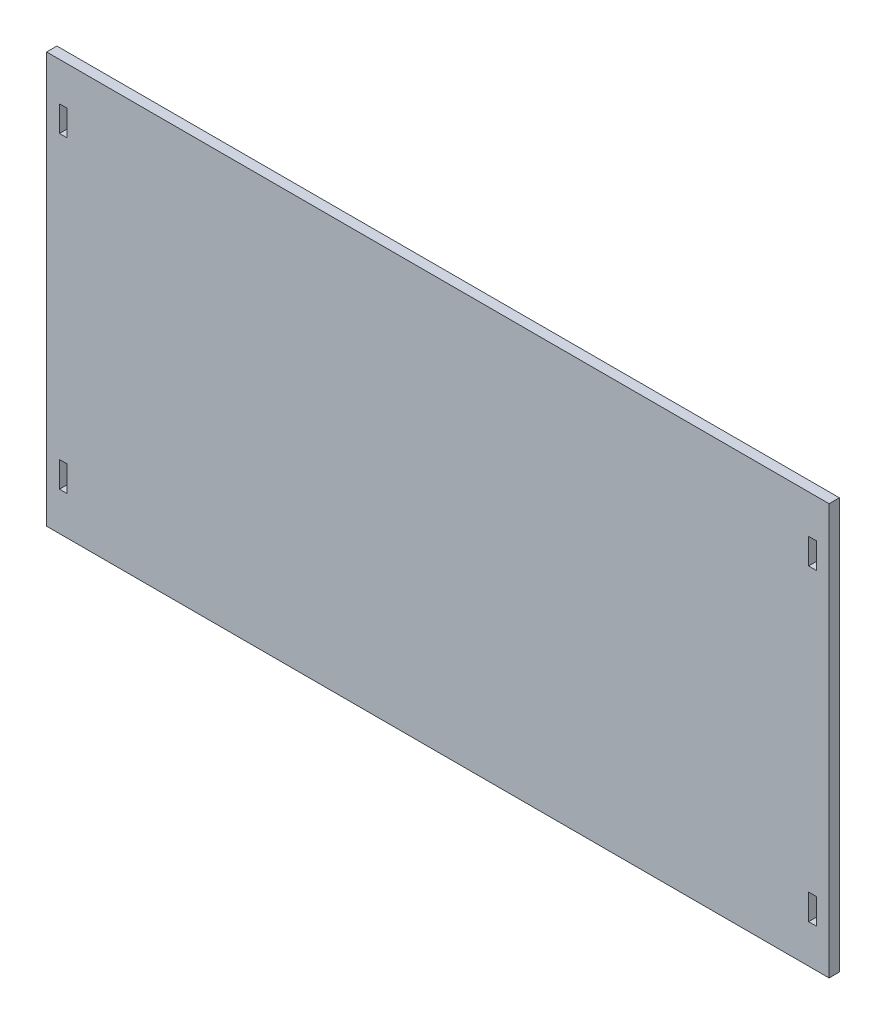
ISO-10303-21;
HEADER;
FILE_DESCRIPTION(('STEP AP214'),'2;1');
FILE_NAME('part.step','',(''),(''),'','','');
FILE_SCHEMA(('AUTOMOTIVE_DESIGN { 1 0 10303 214 1 1 1 1 }'));
ENDSEC;
DATA;
#1=APPLICATION_CONTEXT('core data for automotive mechanical design processes');
#2=APPLICATION_PROTOCOL_DEFINITION('international standard','automotive_design',2000,#1);
#3=PRODUCT_CONTEXT('',#1,'mechanical');
#4=PRODUCT('Part','Part','',(#3));
#5=PRODUCT_RELATED_PRODUCT_CATEGORY('part','',(#4));
#6=PRODUCT_DEFINITION_FORMATION('','',#4);
#7=PRODUCT_DEFINITION_CONTEXT('part definition',#1,'design');
#8=PRODUCT_DEFINITION('design','',#6,#7);
#9=PRODUCT_DEFINITION_SHAPE('','',#8);
#10=(LENGTH_UNIT() NAMED_UNIT(*) SI_UNIT(.MILLI.,.METRE.));
#11=(NAMED_UNIT(*) PLANE_ANGLE_UNIT() SI_UNIT($,.RADIAN.));
#12=(NAMED_UNIT(*) SI_UNIT($,.STERADIAN.) SOLID_ANGLE_UNIT());
#13=UNCERTAINTY_MEASURE_WITH_UNIT(LENGTH_MEASURE(1.E-05),#10,'distance_accuracy_value','');
#14=(GEOMETRIC_REPRESENTATION_CONTEXT(3) GLOBAL_UNCERTAINTY_ASSIGNED_CONTEXT((#13)) GLOBAL_UNIT_ASSIGNED_CONTEXT((#10,
#11,#12)) REPRESENTATION_CONTEXT('',''));
#15=CARTESIAN_POINT('',(0.,0.,0.));
#16=DIRECTION('',(0.,0.,1.));
#17=DIRECTION('',(1.,0.,0.));
#18=AXIS2_PLACEMENT_3D('',#15,#16,#17);
#19=CARTESIAN_POINT('',(0.,0.,4.));
#20=DIRECTION('',(0.,0.,1.));
#21=DIRECTION('',(1.,0.,0.));
#22=AXIS2_PLACEMENT_3D('',#19,#20,#21);
#23=PLANE('',#22);
#24=DIRECTION('',(0.,1.,0.));
#25=VECTOR('',#24,1.);
#26=CARTESIAN_POINT('',(240.959847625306,21.1041826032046,4.));
#27=LINE('',#26,#25);
#28=CARTESIAN_POINT('',(240.959847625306,-128.895817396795,4.));
#29=VERTEX_POINT('',#28);
#30=CARTESIAN_POINT('',(240.959847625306,31.1041826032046,4.));
#31=VERTEX_POINT('',#30);
#32=EDGE_CURVE('E299',#29,#31,#27,.T.);
#33=ORIENTED_EDGE('',*,*,#32,.T.);
#34=DIRECTION('',(-1.,0.,0.));
#35=VECTOR('',#34,1.);
#36=CARTESIAN_POINT('',(-63.8401523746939,31.1041826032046,4.));
#37=LINE('',#36,#35);
#38=CARTESIAN_POINT('',(-63.8401523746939,31.1041826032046,4.));
#39=VERTEX_POINT('',#38);
#40=EDGE_CURVE('E301',#31,#39,#37,.T.);
#41=ORIENTED_EDGE('',*,*,#40,.T.);
#42=DIRECTION('',(0.,-1.,0.));
#43=VECTOR('',#42,1.);
#44=CARTESIAN_POINT('',(-63.8401523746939,21.1041826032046,4.));
#45=LINE('',#44,#43);
#46=CARTESIAN_POINT('',(-63.8401523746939,-128.895817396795,4.));
#47=VERTEX_POINT('',#46);
#48=EDGE_CURVE('E304',#39,#47,#45,.T.);
#49=ORIENTED_EDGE('',*,*,#48,.T.);
#50=DIRECTION('',(1.,0.,0.));
#51=VECTOR('',#50,1.);
#52=CARTESIAN_POINT('',(-63.8401523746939,-128.895817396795,4.));
#53=LINE('',#52,#51);
#54=EDGE_CURVE('E306',#47,#29,#53,.T.);
#55=ORIENTED_EDGE('',*,*,#54,.T.);
#56=EDGE_LOOP('',(#33,#41,#49,#55));
#57=FACE_BOUND('',#56,.T.);
#58=DIRECTION('',(-1.,0.,0.));
#59=VECTOR('',#58,1.);
#60=CARTESIAN_POINT('',(-58.8401523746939,16.1041826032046,4.));
#61=LINE('',#60,#59);
#62=CARTESIAN_POINT('',(-55.8401523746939,16.1041826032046,4.));
#63=VERTEX_POINT('',#62);
#64=CARTESIAN_POINT('',(-58.8401523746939,16.1041826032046,4.));
#65=VERTEX_POINT('',#64);
#66=EDGE_CURVE('E286',#63,#65,#61,.T.);
#67=ORIENTED_EDGE('',*,*,#66,.F.);
#68=DIRECTION('',(0.,1.,0.));
#69=VECTOR('',#68,1.);
#70=CARTESIAN_POINT('',(-55.8401523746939,16.1041826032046,4.));
#71=LINE('',#70,#69);
#72=CARTESIAN_POINT('',(-55.8401523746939,6.10418260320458,4.));
#73=VERTEX_POINT('',#72);
#74=EDGE_CURVE('E289',#73,#63,#71,.T.);
#75=ORIENTED_EDGE('',*,*,#74,.F.);
#76=DIRECTION('',(1.,0.,0.));
#77=VECTOR('',#76,1.);
#78=CARTESIAN_POINT('',(-58.8401523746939,6.10418260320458,4.));
#79=LINE('',#78,#77);
#80=CARTESIAN_POINT('',(-58.8401523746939,6.10418260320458,4.));
#81=VERTEX_POINT('',#80);
#82=EDGE_CURVE('E270',#81,#73,#79,.T.);
#83=ORIENTED_EDGE('',*,*,#82,.F.);
#84=DIRECTION('',(0.,-1.,0.));
#85=VECTOR('',#84,1.);
#86=CARTESIAN_POINT('',(-58.8401523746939,16.1041826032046,4.));
#87=LINE('',#86,#85);
#88=EDGE_CURVE('E283',#65,#81,#87,.T.);
#89=ORIENTED_EDGE('',*,*,#88,.F.);
#90=EDGE_LOOP('',(#67,#75,#83,#89));
#91=FACE_BOUND('',#90,.T.);
#92=DIRECTION('',(1.,0.,0.));
#93=VECTOR('',#92,1.);
#94=CARTESIAN_POINT('',(235.959847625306,6.10418260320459,4.));
#95=LINE('',#94,#93);
#96=CARTESIAN_POINT('',(232.959847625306,6.10418260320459,4.));
#97=VERTEX_POINT('',#96);
#98=CARTESIAN_POINT('',(235.959847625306,6.10418260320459,4.));
#99=VERTEX_POINT('',#98);
#100=EDGE_CURVE('E254',#97,#99,#95,.T.);
#101=ORIENTED_EDGE('',*,*,#100,.F.);
#102=DIRECTION('',(0.,-1.,0.));
#103=VECTOR('',#102,1.);
#104=CARTESIAN_POINT('',(232.959847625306,16.1041826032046,4.));
#105=LINE('',#104,#103);
#106=CARTESIAN_POINT('',(232.959847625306,16.1041826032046,4.));
#107=VERTEX_POINT('',#106);
#108=EDGE_CURVE('E257',#107,#97,#105,.T.);
#109=ORIENTED_EDGE('',*,*,#108,.F.);
#110=DIRECTION('',(-1.,0.,0.));
#111=VECTOR('',#110,1.);
#112=CARTESIAN_POINT('',(235.959847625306,16.1041826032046,4.));
#113=LINE('',#112,#111);
#114=CARTESIAN_POINT('',(235.959847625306,16.1041826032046,4.));
#115=VERTEX_POINT('',#114);
#116=EDGE_CURVE('E239',#115,#107,#113,.T.);
#117=ORIENTED_EDGE('',*,*,#116,.F.);
#118=DIRECTION('',(0.,1.,0.));
#119=VECTOR('',#118,1.);
#120=CARTESIAN_POINT('',(235.959847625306,16.1041826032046,4.));
#121=LINE('',#120,#119);
#122=EDGE_CURVE('E235',#99,#115,#121,.T.);
#123=ORIENTED_EDGE('',*,*,#122,.F.);
#124=EDGE_LOOP('',(#101,#109,#117,#123));
#125=FACE_BOUND('',#124,.T.);
#126=DIRECTION('',(-1.,0.,0.));
#127=VECTOR('',#126,1.);
#128=CARTESIAN_POINT('',(235.959847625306,-103.895817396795,4.));
#129=LINE('',#128,#127);
#130=CARTESIAN_POINT('',(235.959847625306,-103.895817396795,4.));
#131=VERTEX_POINT('',#130);
#132=CARTESIAN_POINT('',(232.959847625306,-103.895817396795,4.));
#133=VERTEX_POINT('',#132);
#134=EDGE_CURVE('E222',#131,#133,#129,.T.);
#135=ORIENTED_EDGE('',*,*,#134,.F.);
#136=DIRECTION('',(0.,1.,0.));
#137=VECTOR('',#136,1.);
#138=CARTESIAN_POINT('',(235.959847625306,-113.895817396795,4.));
#139=LINE('',#138,#137);
#140=CARTESIAN_POINT('',(235.959847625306,-113.895817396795,4.));
#141=VERTEX_POINT('',#140);
#142=EDGE_CURVE('E225',#141,#131,#139,.T.);
#143=ORIENTED_EDGE('',*,*,#142,.F.);
#144=DIRECTION('',(1.,0.,0.));
#145=VECTOR('',#144,1.);
#146=CARTESIAN_POINT('',(235.959847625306,-113.895817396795,4.));
#147=LINE('',#146,#145);
#148=CARTESIAN_POINT('',(232.959847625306,-113.895817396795,4.));
#149=VERTEX_POINT('',#148);
#150=EDGE_CURVE('E207',#149,#141,#147,.T.);
#151=ORIENTED_EDGE('',*,*,#150,.F.);
#152=DIRECTION('',(0.,-1.,0.));
#153=VECTOR('',#152,1.);
#154=CARTESIAN_POINT('',(232.959847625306,-113.895817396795,4.));
#155=LINE('',#154,#153);
#156=EDGE_CURVE('E56',#133,#149,#155,.T.);
#157=ORIENTED_EDGE('',*,*,#156,.F.);
#158=EDGE_LOOP('',(#135,#143,#151,#157));
#159=FACE_BOUND('',#158,.T.);
#160=DIRECTION('',(1.,0.,0.));
#161=VECTOR('',#160,1.);
#162=CARTESIAN_POINT('',(-58.8401523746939,-113.895817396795,4.));
#163=LINE('',#162,#161);
#164=CARTESIAN_POINT('',(-58.8401523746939,-113.895817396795,4.));
#165=VERTEX_POINT('',#164);
#166=CARTESIAN_POINT('',(-55.8401523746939,-113.895817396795,4.));
#167=VERTEX_POINT('',#166);
#168=EDGE_CURVE('E174',#165,#167,#163,.T.);
#169=ORIENTED_EDGE('',*,*,#168,.F.);
#170=DIRECTION('',(0.,-1.,0.));
#171=VECTOR('',#170,1.);
#172=CARTESIAN_POINT('',(-58.8401523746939,-113.895817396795,4.));
#173=LINE('',#172,#171);
#174=CARTESIAN_POINT('',(-58.8401523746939,-103.895817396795,4.));
#175=VERTEX_POINT('',#174);
#176=EDGE_CURVE('E182',#175,#165,#173,.T.);
#177=ORIENTED_EDGE('',*,*,#176,.F.);
#178=DIRECTION('',(-1.,0.,0.));
#179=VECTOR('',#178,1.);
#180=CARTESIAN_POINT('',(-58.8401523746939,-103.895817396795,4.));
#181=LINE('',#180,#179);
#182=CARTESIAN_POINT('',(-55.8401523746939,-103.895817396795,4.));
#183=VERTEX_POINT('',#182);
#184=EDGE_CURVE('E189',#183,#175,#181,.T.);
#185=ORIENTED_EDGE('',*,*,#184,.F.);
#186=DIRECTION('',(0.,1.,0.));
#187=VECTOR('',#186,1.);
#188=CARTESIAN_POINT('',(-55.8401523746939,-113.895817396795,4.));
#189=LINE('',#188,#187);
#190=EDGE_CURVE('E48',#167,#183,#189,.T.);
#191=ORIENTED_EDGE('',*,*,#190,.F.);
#192=EDGE_LOOP('',(#169,#177,#185,#191));
#193=FACE_BOUND('',#192,.T.);
#194=ADVANCED_FACE('F33',(#57,#91,#125,#159,#193),#23,.T.);
#195=CARTESIAN_POINT('',(0.,0.,0.));
#196=DIRECTION('',(0.,0.,1.));
#197=DIRECTION('',(1.,0.,0.));
#198=AXIS2_PLACEMENT_3D('',#195,#196,#197);
#199=PLANE('',#198);
#200=DIRECTION('',(0.,1.,0.));
#201=VECTOR('',#200,1.);
#202=CARTESIAN_POINT('',(235.959847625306,-113.895817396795,0.));
#203=LINE('',#202,#201);
#204=CARTESIAN_POINT('',(235.959847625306,-113.895817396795,0.));
#205=VERTEX_POINT('',#204);
#206=CARTESIAN_POINT('',(235.959847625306,-103.895817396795,0.));
#207=VERTEX_POINT('',#206);
#208=EDGE_CURVE('E217',#205,#207,#203,.T.);
#209=ORIENTED_EDGE('',*,*,#208,.T.);
#210=DIRECTION('',(-1.,0.,0.));
#211=VECTOR('',#210,1.);
#212=CARTESIAN_POINT('',(235.959847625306,-103.895817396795,0.));
#213=LINE('',#212,#211);
#214=CARTESIAN_POINT('',(232.959847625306,-103.895817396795,0.));
#215=VERTEX_POINT('',#214);
#216=EDGE_CURVE('E213',#207,#215,#213,.T.);
#217=ORIENTED_EDGE('',*,*,#216,.T.);
#218=DIRECTION('',(0.,-1.,0.));
#219=VECTOR('',#218,1.);
#220=CARTESIAN_POINT('',(232.959847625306,-113.895817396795,0.));
#221=LINE('',#220,#219);
#222=CARTESIAN_POINT('',(232.959847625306,-113.895817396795,0.));
#223=VERTEX_POINT('',#222);
#224=EDGE_CURVE('E209',#215,#223,#221,.T.);
#225=ORIENTED_EDGE('',*,*,#224,.T.);
#226=DIRECTION('',(1.,0.,0.));
#227=VECTOR('',#226,1.);
#228=CARTESIAN_POINT('',(235.959847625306,-113.895817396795,0.));
#229=LINE('',#228,#227);
#230=EDGE_CURVE('E204',#223,#205,#229,.T.);
#231=ORIENTED_EDGE('',*,*,#230,.T.);
#232=EDGE_LOOP('',(#209,#217,#225,#231));
#233=FACE_BOUND('',#232,.T.);
#234=DIRECTION('',(0.,1.,0.));
#235=VECTOR('',#234,1.);
#236=CARTESIAN_POINT('',(-55.8401523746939,16.1041826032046,0.));
#237=LINE('',#236,#235);
#238=CARTESIAN_POINT('',(-55.8401523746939,6.10418260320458,0.));
#239=VERTEX_POINT('',#238);
#240=CARTESIAN_POINT('',(-55.8401523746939,16.1041826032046,0.));
#241=VERTEX_POINT('',#240);
#242=EDGE_CURVE('E280',#239,#241,#237,.T.);
#243=ORIENTED_EDGE('',*,*,#242,.T.);
#244=DIRECTION('',(-1.,0.,0.));
#245=VECTOR('',#244,1.);
#246=CARTESIAN_POINT('',(-58.8401523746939,16.1041826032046,0.));
#247=LINE('',#246,#245);
#248=CARTESIAN_POINT('',(-58.8401523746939,16.1041826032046,0.));
#249=VERTEX_POINT('',#248);
#250=EDGE_CURVE('E276',#241,#249,#247,.T.);
#251=ORIENTED_EDGE('',*,*,#250,.T.);
#252=DIRECTION('',(0.,-1.,0.));
#253=VECTOR('',#252,1.);
#254=CARTESIAN_POINT('',(-58.8401523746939,16.1041826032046,0.));
#255=LINE('',#254,#253);
#256=CARTESIAN_POINT('',(-58.8401523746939,6.10418260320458,0.));
#257=VERTEX_POINT('',#256);
#258=EDGE_CURVE('E272',#249,#257,#255,.T.);
#259=ORIENTED_EDGE('',*,*,#258,.T.);
#260=DIRECTION('',(1.,0.,0.));
#261=VECTOR('',#260,1.);
#262=CARTESIAN_POINT('',(-58.8401523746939,6.10418260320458,0.));
#263=LINE('',#262,#261);
#264=EDGE_CURVE('E267',#257,#239,#263,.T.);
#265=ORIENTED_EDGE('',*,*,#264,.T.);
#266=EDGE_LOOP('',(#243,#251,#259,#265));
#267=FACE_BOUND('',#266,.T.);
#268=DIRECTION('',(0.,1.,0.));
#269=VECTOR('',#268,1.);
#270=CARTESIAN_POINT('',(240.959847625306,31.1041826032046,0.));
#271=LINE('',#270,#269);
#272=CARTESIAN_POINT('',(240.959847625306,-128.895817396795,0.));
#273=VERTEX_POINT('',#272);
#274=CARTESIAN_POINT('',(240.959847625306,31.1041826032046,0.));
#275=VERTEX_POINT('',#274);
#276=EDGE_CURVE('E285',#273,#275,#271,.T.);
#277=ORIENTED_EDGE('',*,*,#276,.F.);
#278=DIRECTION('',(1.,0.,0.));
#279=VECTOR('',#278,1.);
#280=CARTESIAN_POINT('',(-63.8401523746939,-128.895817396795,0.));
#281=LINE('',#280,#279);
#282=CARTESIAN_POINT('',(-63.8401523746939,-128.895817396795,0.));
#283=VERTEX_POINT('',#282);
#284=EDGE_CURVE('E302',#283,#273,#281,.T.);
#285=ORIENTED_EDGE('',*,*,#284,.F.);
#286=DIRECTION('',(0.,-1.,0.));
#287=VECTOR('',#286,1.);
#288=CARTESIAN_POINT('',(-63.8401523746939,21.1041826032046,0.));
#289=LINE('',#288,#287);
#290=CARTESIAN_POINT('',(-63.8401523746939,31.1041826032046,0.));
#291=VERTEX_POINT('',#290);
#292=EDGE_CURVE('E313',#291,#283,#289,.T.);
#293=ORIENTED_EDGE('',*,*,#292,.F.);
#294=DIRECTION('',(-1.,0.,0.));
#295=VECTOR('',#294,1.);
#296=CARTESIAN_POINT('',(-63.8401523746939,31.1041826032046,0.));
#297=LINE('',#296,#295);
#298=EDGE_CURVE('E310',#275,#291,#297,.T.);
#299=ORIENTED_EDGE('',*,*,#298,.F.);
#300=EDGE_LOOP('',(#277,#285,#293,#299));
#301=FACE_BOUND('',#300,.T.);
#302=DIRECTION('',(0.,-1.,0.));
#303=VECTOR('',#302,1.);
#304=CARTESIAN_POINT('',(232.959847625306,16.1041826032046,0.));
#305=LINE('',#304,#303);
#306=CARTESIAN_POINT('',(232.959847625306,16.1041826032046,0.));
#307=VERTEX_POINT('',#306);
#308=CARTESIAN_POINT('',(232.959847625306,6.10418260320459,0.));
#309=VERTEX_POINT('',#308);
#310=EDGE_CURVE('E249',#307,#309,#305,.T.);
#311=ORIENTED_EDGE('',*,*,#310,.T.);
#312=DIRECTION('',(1.,0.,0.));
#313=VECTOR('',#312,1.);
#314=CARTESIAN_POINT('',(235.959847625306,6.10418260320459,0.));
#315=LINE('',#314,#313);
#316=CARTESIAN_POINT('',(235.959847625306,6.10418260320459,0.));
#317=VERTEX_POINT('',#316);
#318=EDGE_CURVE('E245',#309,#317,#315,.T.);
#319=ORIENTED_EDGE('',*,*,#318,.T.);
#320=DIRECTION('',(0.,1.,0.));
#321=VECTOR('',#320,1.);
#322=CARTESIAN_POINT('',(235.959847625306,16.1041826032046,0.));
#323=LINE('',#322,#321);
#324=CARTESIAN_POINT('',(235.959847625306,16.1041826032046,0.));
#325=VERTEX_POINT('',#324);
#326=EDGE_CURVE('E241',#317,#325,#323,.T.);
#327=ORIENTED_EDGE('',*,*,#326,.T.);
#328=DIRECTION('',(-1.,0.,0.));
#329=VECTOR('',#328,1.);
#330=CARTESIAN_POINT('',(235.959847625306,16.1041826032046,0.));
#331=LINE('',#330,#329);
#332=EDGE_CURVE('E236',#325,#307,#331,.T.);
#333=ORIENTED_EDGE('',*,*,#332,.T.);
#334=EDGE_LOOP('',(#311,#319,#327,#333));
#335=FACE_BOUND('',#334,.T.);
#336=DIRECTION('',(0.,-1.,0.));
#337=VECTOR('',#336,1.);
#338=CARTESIAN_POINT('',(-58.8401523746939,-113.895817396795,0.));
#339=LINE('',#338,#337);
#340=CARTESIAN_POINT('',(-58.8401523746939,-103.895817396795,0.));
#341=VERTEX_POINT('',#340);
#342=CARTESIAN_POINT('',(-58.8401523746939,-113.895817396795,0.));
#343=VERTEX_POINT('',#342);
#344=EDGE_CURVE('E179',#341,#343,#339,.T.);
#345=ORIENTED_EDGE('',*,*,#344,.T.);
#346=DIRECTION('',(1.,0.,0.));
#347=VECTOR('',#346,1.);
#348=CARTESIAN_POINT('',(-58.8401523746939,-113.895817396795,0.));
#349=LINE('',#348,#347);
#350=CARTESIAN_POINT('',(-55.8401523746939,-113.895817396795,0.));
#351=VERTEX_POINT('',#350);
#352=EDGE_CURVE('E176',#343,#351,#349,.T.);
#353=ORIENTED_EDGE('',*,*,#352,.T.);
#354=DIRECTION('',(0.,1.,0.));
#355=VECTOR('',#354,1.);
#356=CARTESIAN_POINT('',(-55.8401523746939,-113.895817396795,0.));
#357=LINE('',#356,#355);
#358=CARTESIAN_POINT('',(-55.8401523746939,-103.895817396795,0.));
#359=VERTEX_POINT('',#358);
#360=EDGE_CURVE('E200',#351,#359,#357,.T.);
#361=ORIENTED_EDGE('',*,*,#360,.T.);
#362=DIRECTION('',(-1.,0.,0.));
#363=VECTOR('',#362,1.);
#364=CARTESIAN_POINT('',(-58.8401523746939,-103.895817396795,0.));
#365=LINE('',#364,#363);
#366=EDGE_CURVE('E196',#359,#341,#365,.T.);
#367=ORIENTED_EDGE('',*,*,#366,.T.);
#368=EDGE_LOOP('',(#345,#353,#361,#367));
#369=FACE_BOUND('',#368,.T.);
#370=ADVANCED_FACE('F333',(#233,#267,#301,#335,#369),#199,.F.);
#371=CARTESIAN_POINT('',(240.959847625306,31.1041826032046,4.));
#372=DIRECTION('',(-1.,0.,0.));
#373=DIRECTION('',(0.,0.,1.));
#374=AXIS2_PLACEMENT_3D('',#371,#372,#373);
#375=PLANE('',#374);
#376=ORIENTED_EDGE('',*,*,#276,.T.);
#377=DIRECTION('',(0.,0.,-1.));
#378=VECTOR('',#377,1.);
#379=CARTESIAN_POINT('',(240.959847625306,31.1041826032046,4.));
#380=LINE('',#379,#378);
#381=EDGE_CURVE('E11',#31,#275,#380,.T.);
#382=ORIENTED_EDGE('',*,*,#381,.F.);
#383=ORIENTED_EDGE('',*,*,#32,.F.);
#384=DIRECTION('',(0.,0.,-1.));
#385=VECTOR('',#384,1.);
#386=CARTESIAN_POINT('',(240.959847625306,-128.895817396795,4.));
#387=LINE('',#386,#385);
#388=EDGE_CURVE('E308',#29,#273,#387,.T.);
#389=ORIENTED_EDGE('',*,*,#388,.T.);
#390=EDGE_LOOP('',(#376,#382,#383,#389));
#391=FACE_BOUND('',#390,.T.);
#392=ADVANCED_FACE('F35',(#391),#375,.F.);
#393=CARTESIAN_POINT('',(-63.8401523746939,31.1041826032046,4.));
#394=DIRECTION('',(0.,-1.,0.));
#395=DIRECTION('',(1.,0.,0.));
#396=AXIS2_PLACEMENT_3D('',#393,#394,#395);
#397=PLANE('',#396);
#398=ORIENTED_EDGE('',*,*,#298,.T.);
#399=DIRECTION('',(0.,0.,-1.));
#400=VECTOR('',#399,1.);
#401=CARTESIAN_POINT('',(-63.8401523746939,31.1041826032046,4.));
#402=LINE('',#401,#400);
#403=EDGE_CURVE('E41',#39,#291,#402,.T.);
#404=ORIENTED_EDGE('',*,*,#403,.F.);
#405=ORIENTED_EDGE('',*,*,#40,.F.);
#406=ORIENTED_EDGE('',*,*,#381,.T.);
#407=EDGE_LOOP('',(#398,#404,#405,#406));
#408=FACE_BOUND('',#407,.T.);
#409=ADVANCED_FACE('F329',(#408),#397,.F.);
#410=CARTESIAN_POINT('',(-63.8401523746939,21.1041826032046,4.));
#411=DIRECTION('',(1.,0.,0.));
#412=DIRECTION('',(0.,0.,-1.));
#413=AXIS2_PLACEMENT_3D('',#410,#411,#412);
#414=PLANE('',#413);
#415=ORIENTED_EDGE('',*,*,#292,.T.);
#416=DIRECTION('',(0.,0.,-1.));
#417=VECTOR('',#416,1.);
#418=CARTESIAN_POINT('',(-63.8401523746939,-128.895817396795,4.));
#419=LINE('',#418,#417);
#420=EDGE_CURVE('E319',#47,#283,#419,.T.);
#421=ORIENTED_EDGE('',*,*,#420,.F.);
#422=ORIENTED_EDGE('',*,*,#48,.F.);
#423=ORIENTED_EDGE('',*,*,#403,.T.);
#424=EDGE_LOOP('',(#415,#421,#422,#423));
#425=FACE_BOUND('',#424,.T.);
#426=ADVANCED_FACE('F325',(#425),#414,.F.);
#427=CARTESIAN_POINT('',(-63.8401523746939,-128.895817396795,4.));
#428=DIRECTION('',(0.,1.,0.));
#429=DIRECTION('',(0.,0.,1.));
#430=AXIS2_PLACEMENT_3D('',#427,#428,#429);
#431=PLANE('',#430);
#432=ORIENTED_EDGE('',*,*,#284,.T.);
#433=ORIENTED_EDGE('',*,*,#388,.F.);
#434=ORIENTED_EDGE('',*,*,#54,.F.);
#435=ORIENTED_EDGE('',*,*,#420,.T.);
#436=EDGE_LOOP('',(#432,#433,#434,#435));
#437=FACE_BOUND('',#436,.T.);
#438=ADVANCED_FACE('F338',(#437),#431,.F.);
#439=CARTESIAN_POINT('',(-55.8401523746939,16.1041826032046,14.4403065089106));
#440=DIRECTION('',(-1.,0.,0.));
#441=DIRECTION('',(0.,0.,1.));
#442=AXIS2_PLACEMENT_3D('',#439,#440,#441);
#443=PLANE('',#442);
#444=ORIENTED_EDGE('',*,*,#74,.T.);
#445=DIRECTION('',(0.,0.,-1.));
#446=VECTOR('',#445,1.);
#447=CARTESIAN_POINT('',(-55.8401523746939,16.1041826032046,14.4403065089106));
#448=LINE('',#447,#446);
#449=EDGE_CURVE('E279',#63,#241,#448,.T.);
#450=ORIENTED_EDGE('',*,*,#449,.T.);
#451=ORIENTED_EDGE('',*,*,#242,.F.);
#452=DIRECTION('',(0.,0.,-1.));
#453=VECTOR('',#452,1.);
#454=CARTESIAN_POINT('',(-55.8401523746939,6.10418260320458,14.4403065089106));
#455=LINE('',#454,#453);
#456=EDGE_CURVE('E192',#73,#239,#455,.T.);
#457=ORIENTED_EDGE('',*,*,#456,.F.);
#458=EDGE_LOOP('',(#444,#450,#451,#457));
#459=FACE_BOUND('',#458,.T.);
#460=ADVANCED_FACE('F374',(#459),#443,.T.);
#461=CARTESIAN_POINT('',(-58.8401523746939,16.1041826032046,14.4403065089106));
#462=DIRECTION('',(0.,-1.,0.));
#463=DIRECTION('',(0.,0.,-1.));
#464=AXIS2_PLACEMENT_3D('',#461,#462,#463);
#465=PLANE('',#464);
#466=ORIENTED_EDGE('',*,*,#66,.T.);
#467=DIRECTION('',(0.,0.,-1.));
#468=VECTOR('',#467,1.);
#469=CARTESIAN_POINT('',(-58.8401523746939,16.1041826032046,14.4403065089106));
#470=LINE('',#469,#468);
#471=EDGE_CURVE('E275',#65,#249,#470,.T.);
#472=ORIENTED_EDGE('',*,*,#471,.T.);
#473=ORIENTED_EDGE('',*,*,#250,.F.);
#474=ORIENTED_EDGE('',*,*,#449,.F.);
#475=EDGE_LOOP('',(#466,#472,#473,#474));
#476=FACE_BOUND('',#475,.T.);
#477=ADVANCED_FACE('F383',(#476),#465,.T.);
#478=CARTESIAN_POINT('',(-58.8401523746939,16.1041826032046,14.4403065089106));
#479=DIRECTION('',(1.,0.,0.));
#480=DIRECTION('',(0.,0.,-1.));
#481=AXIS2_PLACEMENT_3D('',#478,#479,#480);
#482=PLANE('',#481);
#483=ORIENTED_EDGE('',*,*,#88,.T.);
#484=DIRECTION('',(0.,0.,-1.));
#485=VECTOR('',#484,1.);
#486=CARTESIAN_POINT('',(-58.8401523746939,6.10418260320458,14.4403065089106));
#487=LINE('',#486,#485);
#488=EDGE_CURVE('E271',#81,#257,#487,.T.);
#489=ORIENTED_EDGE('',*,*,#488,.T.);
#490=ORIENTED_EDGE('',*,*,#258,.F.);
#491=ORIENTED_EDGE('',*,*,#471,.F.);
#492=EDGE_LOOP('',(#483,#489,#490,#491));
#493=FACE_BOUND('',#492,.T.);
#494=ADVANCED_FACE('F380',(#493),#482,.T.);
#495=CARTESIAN_POINT('',(-58.8401523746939,6.10418260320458,14.4403065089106));
#496=DIRECTION('',(0.,1.,0.));
#497=DIRECTION('',(0.,0.,1.));
#498=AXIS2_PLACEMENT_3D('',#495,#496,#497);
#499=PLANE('',#498);
#500=ORIENTED_EDGE('',*,*,#82,.T.);
#501=ORIENTED_EDGE('',*,*,#456,.T.);
#502=ORIENTED_EDGE('',*,*,#264,.F.);
#503=ORIENTED_EDGE('',*,*,#488,.F.);
#504=EDGE_LOOP('',(#500,#501,#502,#503));
#505=FACE_BOUND('',#504,.T.);
#506=ADVANCED_FACE('F376',(#505),#499,.T.);
#507=CARTESIAN_POINT('',(232.959847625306,16.1041826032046,14.4403065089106));
#508=DIRECTION('',(1.,0.,0.));
#509=DIRECTION('',(0.,0.,-1.));
#510=AXIS2_PLACEMENT_3D('',#507,#508,#509);
#511=PLANE('',#510);
#512=ORIENTED_EDGE('',*,*,#108,.T.);
#513=DIRECTION('',(0.,0.,-1.));
#514=VECTOR('',#513,1.);
#515=CARTESIAN_POINT('',(232.959847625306,6.10418260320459,14.4403065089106));
#516=LINE('',#515,#514);
#517=EDGE_CURVE('E248',#97,#309,#516,.T.);
#518=ORIENTED_EDGE('',*,*,#517,.T.);
#519=ORIENTED_EDGE('',*,*,#310,.F.);
#520=DIRECTION('',(0.,0.,-1.));
#521=VECTOR('',#520,1.);
#522=CARTESIAN_POINT('',(232.959847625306,16.1041826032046,14.4403065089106));
#523=LINE('',#522,#521);
#524=EDGE_CURVE('E252',#107,#307,#523,.T.);
#525=ORIENTED_EDGE('',*,*,#524,.F.);
#526=EDGE_LOOP('',(#512,#518,#519,#525));
#527=FACE_BOUND('',#526,.T.);
#528=ADVANCED_FACE('F460',(#527),#511,.T.);
#529=CARTESIAN_POINT('',(235.959847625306,6.10418260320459,14.4403065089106));
#530=DIRECTION('',(0.,1.,0.));
#531=DIRECTION('',(0.,0.,1.));
#532=AXIS2_PLACEMENT_3D('',#529,#530,#531);
#533=PLANE('',#532);
#534=ORIENTED_EDGE('',*,*,#100,.T.);
#535=DIRECTION('',(0.,0.,-1.));
#536=VECTOR('',#535,1.);
#537=CARTESIAN_POINT('',(235.959847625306,6.10418260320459,14.4403065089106));
#538=LINE('',#537,#536);
#539=EDGE_CURVE('E244',#99,#317,#538,.T.);
#540=ORIENTED_EDGE('',*,*,#539,.T.);
#541=ORIENTED_EDGE('',*,*,#318,.F.);
#542=ORIENTED_EDGE('',*,*,#517,.F.);
#543=EDGE_LOOP('',(#534,#540,#541,#542));
#544=FACE_BOUND('',#543,.T.);
#545=ADVANCED_FACE('F468',(#544),#533,.T.);
#546=CARTESIAN_POINT('',(235.959847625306,16.1041826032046,14.4403065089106));
#547=DIRECTION('',(-1.,0.,0.));
#548=DIRECTION('',(0.,0.,1.));
#549=AXIS2_PLACEMENT_3D('',#546,#547,#548);
#550=PLANE('',#549);
#551=ORIENTED_EDGE('',*,*,#122,.T.);
#552=DIRECTION('',(0.,0.,-1.));
#553=VECTOR('',#552,1.);
#554=CARTESIAN_POINT('',(235.959847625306,16.1041826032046,14.4403065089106));
#555=LINE('',#554,#553);
#556=EDGE_CURVE('E240',#115,#325,#555,.T.);
#557=ORIENTED_EDGE('',*,*,#556,.T.);
#558=ORIENTED_EDGE('',*,*,#326,.F.);
#559=ORIENTED_EDGE('',*,*,#539,.F.);
#560=EDGE_LOOP('',(#551,#557,#558,#559));
#561=FACE_BOUND('',#560,.T.);
#562=ADVANCED_FACE('F478',(#561),#550,.T.);
#563=CARTESIAN_POINT('',(235.959847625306,16.1041826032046,14.4403065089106));
#564=DIRECTION('',(0.,-1.,0.));
#565=DIRECTION('',(0.,0.,-1.));
#566=AXIS2_PLACEMENT_3D('',#563,#564,#565);
#567=PLANE('',#566);
#568=ORIENTED_EDGE('',*,*,#116,.T.);
#569=ORIENTED_EDGE('',*,*,#524,.T.);
#570=ORIENTED_EDGE('',*,*,#332,.F.);
#571=ORIENTED_EDGE('',*,*,#556,.F.);
#572=EDGE_LOOP('',(#568,#569,#570,#571));
#573=FACE_BOUND('',#572,.T.);
#574=ADVANCED_FACE('F488',(#573),#567,.T.);
#575=CARTESIAN_POINT('',(235.959847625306,-113.895817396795,14.4403065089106));
#576=DIRECTION('',(-1.,0.,0.));
#577=DIRECTION('',(0.,-1.,0.));
#578=AXIS2_PLACEMENT_3D('',#575,#576,#577);
#579=PLANE('',#578);
#580=ORIENTED_EDGE('',*,*,#142,.T.);
#581=DIRECTION('',(0.,0.,-1.));
#582=VECTOR('',#581,1.);
#583=CARTESIAN_POINT('',(235.959847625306,-103.895817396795,14.4403065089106));
#584=LINE('',#583,#582);
#585=EDGE_CURVE('E216',#131,#207,#584,.T.);
#586=ORIENTED_EDGE('',*,*,#585,.T.);
#587=ORIENTED_EDGE('',*,*,#208,.F.);
#588=DIRECTION('',(0.,0.,-1.));
#589=VECTOR('',#588,1.);
#590=CARTESIAN_POINT('',(235.959847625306,-113.895817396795,14.4403065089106));
#591=LINE('',#590,#589);
#592=EDGE_CURVE('E220',#141,#205,#591,.T.);
#593=ORIENTED_EDGE('',*,*,#592,.F.);
#594=EDGE_LOOP('',(#580,#586,#587,#593));
#595=FACE_BOUND('',#594,.T.);
#596=ADVANCED_FACE('F362',(#595),#579,.T.);
#597=CARTESIAN_POINT('',(235.959847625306,-103.895817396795,14.4403065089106));
#598=DIRECTION('',(0.,-1.,0.));
#599=DIRECTION('',(1.,0.,0.));
#600=AXIS2_PLACEMENT_3D('',#597,#598,#599);
#601=PLANE('',#600);
#602=ORIENTED_EDGE('',*,*,#134,.T.);
#603=DIRECTION('',(0.,0.,-1.));
#604=VECTOR('',#603,1.);
#605=CARTESIAN_POINT('',(232.959847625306,-103.895817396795,14.4403065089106));
#606=LINE('',#605,#604);
#607=EDGE_CURVE('E212',#133,#215,#606,.T.);
#608=ORIENTED_EDGE('',*,*,#607,.T.);
#609=ORIENTED_EDGE('',*,*,#216,.F.);
#610=ORIENTED_EDGE('',*,*,#585,.F.);
#611=EDGE_LOOP('',(#602,#608,#609,#610));
#612=FACE_BOUND('',#611,.T.);
#613=ADVANCED_FACE('F358',(#612),#601,.T.);
#614=CARTESIAN_POINT('',(232.959847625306,-113.895817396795,14.4403065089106));
#615=DIRECTION('',(1.,0.,0.));
#616=DIRECTION('',(0.,0.,-1.));
#617=AXIS2_PLACEMENT_3D('',#614,#615,#616);
#618=PLANE('',#617);
#619=ORIENTED_EDGE('',*,*,#156,.T.);
#620=DIRECTION('',(0.,0.,-1.));
#621=VECTOR('',#620,1.);
#622=CARTESIAN_POINT('',(232.959847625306,-113.895817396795,14.4403065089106));
#623=LINE('',#622,#621);
#624=EDGE_CURVE('E208',#149,#223,#623,.T.);
#625=ORIENTED_EDGE('',*,*,#624,.T.);
#626=ORIENTED_EDGE('',*,*,#224,.F.);
#627=ORIENTED_EDGE('',*,*,#607,.F.);
#628=EDGE_LOOP('',(#619,#625,#626,#627));
#629=FACE_BOUND('',#628,.T.);
#630=ADVANCED_FACE('F366',(#629),#618,.T.);
#631=CARTESIAN_POINT('',(235.959847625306,-113.895817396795,14.4403065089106));
#632=DIRECTION('',(0.,1.,0.));
#633=DIRECTION('',(0.,0.,1.));
#634=AXIS2_PLACEMENT_3D('',#631,#632,#633);
#635=PLANE('',#634);
#636=ORIENTED_EDGE('',*,*,#150,.T.);
#637=ORIENTED_EDGE('',*,*,#592,.T.);
#638=ORIENTED_EDGE('',*,*,#230,.F.);
#639=ORIENTED_EDGE('',*,*,#624,.F.);
#640=EDGE_LOOP('',(#636,#637,#638,#639));
#641=FACE_BOUND('',#640,.T.);
#642=ADVANCED_FACE('F365',(#641),#635,.T.);
#643=CARTESIAN_POINT('',(-58.8401523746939,-113.895817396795,14.4403065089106));
#644=DIRECTION('',(1.,0.,0.));
#645=DIRECTION('',(0.,0.,-1.));
#646=AXIS2_PLACEMENT_3D('',#643,#644,#645);
#647=PLANE('',#646);
#648=ORIENTED_EDGE('',*,*,#176,.T.);
#649=DIRECTION('',(0.,0.,-1.));
#650=VECTOR('',#649,1.);
#651=CARTESIAN_POINT('',(-58.8401523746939,-113.895817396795,14.4403065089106));
#652=LINE('',#651,#650);
#653=EDGE_CURVE('E170',#165,#343,#652,.T.);
#654=ORIENTED_EDGE('',*,*,#653,.T.);
#655=ORIENTED_EDGE('',*,*,#344,.F.);
#656=DIRECTION('',(0.,0.,-1.));
#657=VECTOR('',#656,1.);
#658=CARTESIAN_POINT('',(-58.8401523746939,-103.895817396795,14.4403065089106));
#659=LINE('',#658,#657);
#660=EDGE_CURVE('E185',#175,#341,#659,.T.);
#661=ORIENTED_EDGE('',*,*,#660,.F.);
#662=EDGE_LOOP('',(#648,#654,#655,#661));
#663=FACE_BOUND('',#662,.T.);
#664=ADVANCED_FACE('F183',(#663),#647,.T.);
#665=CARTESIAN_POINT('',(-58.8401523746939,-113.895817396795,14.4403065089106));
#666=DIRECTION('',(0.,1.,0.));
#667=DIRECTION('',(0.,0.,1.));
#668=AXIS2_PLACEMENT_3D('',#665,#666,#667);
#669=PLANE('',#668);
#670=ORIENTED_EDGE('',*,*,#168,.T.);
#671=DIRECTION('',(0.,0.,-1.));
#672=VECTOR('',#671,1.);
#673=CARTESIAN_POINT('',(-55.8401523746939,-113.895817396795,14.4403065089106));
#674=LINE('',#673,#672);
#675=EDGE_CURVE('E198',#167,#351,#674,.T.);
#676=ORIENTED_EDGE('',*,*,#675,.T.);
#677=ORIENTED_EDGE('',*,*,#352,.F.);
#678=ORIENTED_EDGE('',*,*,#653,.F.);
#679=EDGE_LOOP('',(#670,#676,#677,#678));
#680=FACE_BOUND('',#679,.T.);
#681=ADVANCED_FACE('F172',(#680),#669,.T.);
#682=CARTESIAN_POINT('',(-55.8401523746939,-113.895817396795,14.4403065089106));
#683=DIRECTION('',(-1.,0.,0.));
#684=DIRECTION('',(0.,0.,1.));
#685=AXIS2_PLACEMENT_3D('',#682,#683,#684);
#686=PLANE('',#685);
#687=ORIENTED_EDGE('',*,*,#190,.T.);
#688=DIRECTION('',(0.,0.,-1.));
#689=VECTOR('',#688,1.);
#690=CARTESIAN_POINT('',(-55.8401523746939,-103.895817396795,14.4403065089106));
#691=LINE('',#690,#689);
#692=EDGE_CURVE('E201',#183,#359,#691,.T.);
#693=ORIENTED_EDGE('',*,*,#692,.T.);
#694=ORIENTED_EDGE('',*,*,#360,.F.);
#695=ORIENTED_EDGE('',*,*,#675,.F.);
#696=EDGE_LOOP('',(#687,#693,#694,#695));
#697=FACE_BOUND('',#696,.T.);
#698=ADVANCED_FACE('F547',(#697),#686,.T.);
#699=CARTESIAN_POINT('',(-58.8401523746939,-103.895817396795,14.4403065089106));
#700=DIRECTION('',(0.,-1.,0.));
#701=DIRECTION('',(0.,0.,-1.));
#702=AXIS2_PLACEMENT_3D('',#699,#700,#701);
#703=PLANE('',#702);
#704=ORIENTED_EDGE('',*,*,#184,.T.);
#705=ORIENTED_EDGE('',*,*,#660,.T.);
#706=ORIENTED_EDGE('',*,*,#366,.F.);
#707=ORIENTED_EDGE('',*,*,#692,.F.);
#708=EDGE_LOOP('',(#704,#705,#706,#707));
#709=FACE_BOUND('',#708,.T.);
#710=ADVANCED_FACE('F556',(#709),#703,.T.);
#711=CLOSED_SHELL('',(#194,#370,#392,#409,#426,#438,#460,#477,#494,#506,#528,#545,#562,#574,
#596,#613,#630,#642,#664,#681,#698,#710));
#712=MANIFOLD_SOLID_BREP('B2',#711);
#713=ADVANCED_BREP_SHAPE_REPRESENTATION('',(#18,#712),#14);
#714=SHAPE_DEFINITION_REPRESENTATION(#9,#713);
ENDSEC;
END-ISO-10303-21;
